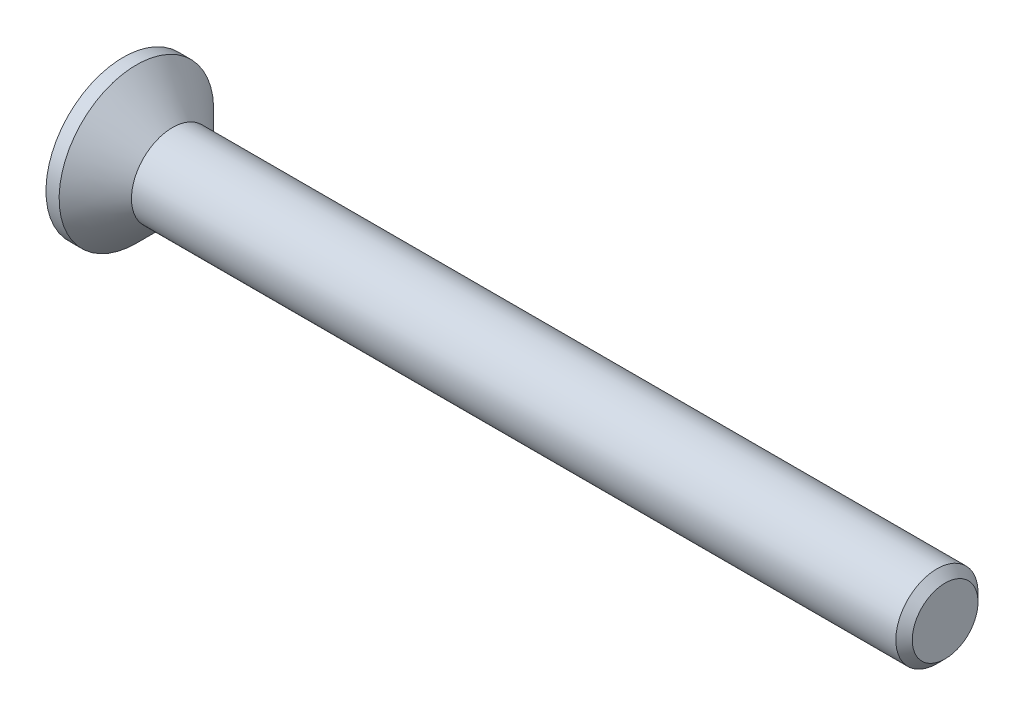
ISO-10303-21;
HEADER;
FILE_DESCRIPTION(('STEP AP214'),'2;1');
FILE_NAME('part.step','',(''),(''),'','','');
FILE_SCHEMA(('AUTOMOTIVE_DESIGN { 1 0 10303 214 1 1 1 1 }'));
ENDSEC;
DATA;
#1=APPLICATION_CONTEXT('core data for automotive mechanical design processes');
#2=APPLICATION_PROTOCOL_DEFINITION('international standard','automotive_design',2000,#1);
#3=PRODUCT_CONTEXT('',#1,'mechanical');
#4=PRODUCT('Part','Part','',(#3));
#5=PRODUCT_RELATED_PRODUCT_CATEGORY('part','',(#4));
#6=PRODUCT_DEFINITION_FORMATION('','',#4);
#7=PRODUCT_DEFINITION_CONTEXT('part definition',#1,'design');
#8=PRODUCT_DEFINITION('design','',#6,#7);
#9=PRODUCT_DEFINITION_SHAPE('','',#8);
#10=(LENGTH_UNIT() NAMED_UNIT(*) SI_UNIT(.MILLI.,.METRE.));
#11=(NAMED_UNIT(*) PLANE_ANGLE_UNIT() SI_UNIT($,.RADIAN.));
#12=(NAMED_UNIT(*) SI_UNIT($,.STERADIAN.) SOLID_ANGLE_UNIT());
#13=UNCERTAINTY_MEASURE_WITH_UNIT(LENGTH_MEASURE(1.E-05),#10,'distance_accuracy_value','');
#14=(GEOMETRIC_REPRESENTATION_CONTEXT(3) GLOBAL_UNCERTAINTY_ASSIGNED_CONTEXT((#13)) GLOBAL_UNIT_ASSIGNED_CONTEXT((#10,
#11,#12)) REPRESENTATION_CONTEXT('',''));
#15=CARTESIAN_POINT('',(0.,0.,0.));
#16=DIRECTION('',(0.,0.,1.));
#17=DIRECTION('',(1.,0.,0.));
#18=AXIS2_PLACEMENT_3D('',#15,#16,#17);
#19=CARTESIAN_POINT('',(0.,0.,0.));
#20=DIRECTION('',(-1.,0.,0.));
#21=DIRECTION('',(0.,-1.,0.));
#22=AXIS2_PLACEMENT_3D('',#19,#20,#21);
#23=CONICAL_SURFACE('',#22,1.25,0.78539816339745);
#24=CARTESIAN_POINT('',(-1.1,0.,0.));
#25=DIRECTION('',(-1.,0.,0.));
#26=DIRECTION('',(0.,-1.,0.));
#27=AXIS2_PLACEMENT_3D('',#24,#25,#26);
#28=CIRCLE('',#27,2.35);
#29=CARTESIAN_POINT('',(-1.1,-2.35,0.));
#30=VERTEX_POINT('',#29);
#31=EDGE_CURVE('E189',#30,#30,#28,.T.);
#32=ORIENTED_EDGE('',*,*,#31,.F.);
#33=EDGE_LOOP('',(#32));
#34=FACE_BOUND('',#33,.T.);
#35=CARTESIAN_POINT('',(0.,0.,0.));
#36=DIRECTION('',(-1.,0.,0.));
#37=DIRECTION('',(0.,-1.,0.));
#38=AXIS2_PLACEMENT_3D('',#35,#36,#37);
#39=CIRCLE('',#38,1.25);
#40=CARTESIAN_POINT('',(0.,-1.25,0.));
#41=VERTEX_POINT('',#40);
#42=EDGE_CURVE('E212',#41,#41,#39,.T.);
#43=ORIENTED_EDGE('',*,*,#42,.T.);
#44=EDGE_LOOP('',(#43));
#45=FACE_BOUND('',#44,.T.);
#46=ADVANCED_FACE('F33',(#34,#45),#23,.T.);
#47=CARTESIAN_POINT('',(-1.5,0.,0.));
#48=DIRECTION('',(-1.,0.,0.));
#49=DIRECTION('',(0.,-1.,0.));
#50=AXIS2_PLACEMENT_3D('',#47,#48,#49);
#51=CYLINDRICAL_SURFACE('',#50,1.25);
#52=CARTESIAN_POINT('',(23.25,0.,0.));
#53=DIRECTION('',(-1.,0.,0.));
#54=DIRECTION('',(0.,-1.,0.));
#55=AXIS2_PLACEMENT_3D('',#52,#53,#54);
#56=CIRCLE('',#55,1.25);
#57=CARTESIAN_POINT('',(23.25,-1.25,0.));
#58=VERTEX_POINT('',#57);
#59=EDGE_CURVE('E41',#58,#58,#56,.T.);
#60=ORIENTED_EDGE('',*,*,#59,.T.);
#61=EDGE_LOOP('',(#60));
#62=FACE_BOUND('',#61,.T.);
#63=ORIENTED_EDGE('',*,*,#42,.F.);
#64=EDGE_LOOP('',(#63));
#65=FACE_BOUND('',#64,.T.);
#66=ADVANCED_FACE('F217',(#62,#65),#51,.T.);
#67=CARTESIAN_POINT('',(23.5,0.,0.));
#68=DIRECTION('',(-1.,0.,0.));
#69=DIRECTION('',(0.,-1.,0.));
#70=AXIS2_PLACEMENT_3D('',#67,#68,#69);
#71=PLANE('',#70);
#72=CARTESIAN_POINT('',(23.5,0.,0.));
#73=DIRECTION('',(-1.,0.,0.));
#74=DIRECTION('',(0.,-1.,0.));
#75=AXIS2_PLACEMENT_3D('',#72,#73,#74);
#76=CIRCLE('',#75,1.);
#77=CARTESIAN_POINT('',(23.5,-1.,0.));
#78=VERTEX_POINT('',#77);
#79=EDGE_CURVE('E11',#78,#78,#76,.F.);
#80=ORIENTED_EDGE('',*,*,#79,.T.);
#81=EDGE_LOOP('',(#80));
#82=FACE_BOUND('',#81,.T.);
#83=ADVANCED_FACE('F239',(#82),#71,.F.);
#84=CARTESIAN_POINT('',(-1.5,2.35,0.));
#85=DIRECTION('',(1.,0.,0.));
#86=DIRECTION('',(0.,1.,0.));
#87=AXIS2_PLACEMENT_3D('',#84,#85,#86);
#88=PLANE('',#87);
#89=DIRECTION('',(0.,0.,-1.));
#90=VECTOR('',#89,1.);
#91=CARTESIAN_POINT('',(-1.5,0.34,-1.35));
#92=LINE('',#91,#90);
#93=CARTESIAN_POINT('',(-1.5,0.34,-0.34));
#94=VERTEX_POINT('',#93);
#95=CARTESIAN_POINT('',(-1.5,0.34,-1.35));
#96=VERTEX_POINT('',#95);
#97=EDGE_CURVE('E158',#94,#96,#92,.T.);
#98=ORIENTED_EDGE('',*,*,#97,.F.);
#99=DIRECTION('',(0.,-1.,0.));
#100=VECTOR('',#99,1.);
#101=CARTESIAN_POINT('',(-1.5,0.34,-0.34));
#102=LINE('',#101,#100);
#103=CARTESIAN_POINT('',(-1.5,1.35,-0.34));
#104=VERTEX_POINT('',#103);
#105=EDGE_CURVE('E48',#104,#94,#102,.T.);
#106=ORIENTED_EDGE('',*,*,#105,.F.);
#107=DIRECTION('',(0.,0.,-1.));
#108=VECTOR('',#107,1.);
#109=CARTESIAN_POINT('',(-1.5,1.35,-0.34));
#110=LINE('',#109,#108);
#111=CARTESIAN_POINT('',(-1.5,1.35,0.34));
#112=VERTEX_POINT('',#111);
#113=EDGE_CURVE('E185',#112,#104,#110,.T.);
#114=ORIENTED_EDGE('',*,*,#113,.F.);
#115=DIRECTION('',(0.,1.,0.));
#116=VECTOR('',#115,1.);
#117=CARTESIAN_POINT('',(-1.5,1.35,0.34));
#118=LINE('',#117,#116);
#119=CARTESIAN_POINT('',(-1.5,0.34,0.34));
#120=VERTEX_POINT('',#119);
#121=EDGE_CURVE('E183',#120,#112,#118,.T.);
#122=ORIENTED_EDGE('',*,*,#121,.F.);
#123=DIRECTION('',(0.,0.,-1.));
#124=VECTOR('',#123,1.);
#125=CARTESIAN_POINT('',(-1.5,0.34,0.34));
#126=LINE('',#125,#124);
#127=CARTESIAN_POINT('',(-1.5,0.34,1.35));
#128=VERTEX_POINT('',#127);
#129=EDGE_CURVE('E132',#128,#120,#126,.T.);
#130=ORIENTED_EDGE('',*,*,#129,.F.);
#131=DIRECTION('',(0.,1.,0.));
#132=VECTOR('',#131,1.);
#133=CARTESIAN_POINT('',(-1.5,0.34,1.35));
#134=LINE('',#133,#132);
#135=CARTESIAN_POINT('',(-1.5,-0.34,1.35));
#136=VERTEX_POINT('',#135);
#137=EDGE_CURVE('E179',#136,#128,#134,.T.);
#138=ORIENTED_EDGE('',*,*,#137,.F.);
#139=DIRECTION('',(0.,0.,1.));
#140=VECTOR('',#139,1.);
#141=CARTESIAN_POINT('',(-1.5,-0.34,1.35));
#142=LINE('',#141,#140);
#143=CARTESIAN_POINT('',(-1.5,-0.34,0.34));
#144=VERTEX_POINT('',#143);
#145=EDGE_CURVE('E176',#144,#136,#142,.T.);
#146=ORIENTED_EDGE('',*,*,#145,.F.);
#147=DIRECTION('',(0.,1.,0.));
#148=VECTOR('',#147,1.);
#149=CARTESIAN_POINT('',(-1.5,-0.34,0.34));
#150=LINE('',#149,#148);
#151=CARTESIAN_POINT('',(-1.5,-1.35,0.34));
#152=VERTEX_POINT('',#151);
#153=EDGE_CURVE('E173',#152,#144,#150,.T.);
#154=ORIENTED_EDGE('',*,*,#153,.F.);
#155=DIRECTION('',(0.,0.,1.));
#156=VECTOR('',#155,1.);
#157=CARTESIAN_POINT('',(-1.5,-1.35,0.34));
#158=LINE('',#157,#156);
#159=CARTESIAN_POINT('',(-1.5,-1.35,-0.34));
#160=VERTEX_POINT('',#159);
#161=EDGE_CURVE('E170',#160,#152,#158,.T.);
#162=ORIENTED_EDGE('',*,*,#161,.F.);
#163=DIRECTION('',(0.,-1.,0.));
#164=VECTOR('',#163,1.);
#165=CARTESIAN_POINT('',(-1.5,-1.35,-0.34));
#166=LINE('',#165,#164);
#167=CARTESIAN_POINT('',(-1.5,-0.34,-0.34));
#168=VERTEX_POINT('',#167);
#169=EDGE_CURVE('E167',#168,#160,#166,.T.);
#170=ORIENTED_EDGE('',*,*,#169,.F.);
#171=DIRECTION('',(0.,0.,1.));
#172=VECTOR('',#171,1.);
#173=CARTESIAN_POINT('',(-1.5,-0.34,-0.34));
#174=LINE('',#173,#172);
#175=CARTESIAN_POINT('',(-1.5,-0.34,-1.35));
#176=VERTEX_POINT('',#175);
#177=EDGE_CURVE('E164',#176,#168,#174,.T.);
#178=ORIENTED_EDGE('',*,*,#177,.F.);
#179=DIRECTION('',(0.,-1.,0.));
#180=VECTOR('',#179,1.);
#181=CARTESIAN_POINT('',(-1.5,-0.34,-1.35));
#182=LINE('',#181,#180);
#183=EDGE_CURVE('E161',#96,#176,#182,.T.);
#184=ORIENTED_EDGE('',*,*,#183,.F.);
#185=EDGE_LOOP('',(#98,#106,#114,#122,#130,#138,#146,#154,#162,#170,#178,#184));
#186=FACE_BOUND('',#185,.T.);
#187=CARTESIAN_POINT('',(-1.5,0.,0.));
#188=DIRECTION('',(-1.,0.,0.));
#189=DIRECTION('',(0.,-1.,0.));
#190=AXIS2_PLACEMENT_3D('',#187,#188,#189);
#191=CIRCLE('',#190,2.35);
#192=CARTESIAN_POINT('',(-1.5,-2.35,0.));
#193=VERTEX_POINT('',#192);
#194=EDGE_CURVE('E209',#193,#193,#191,.T.);
#195=ORIENTED_EDGE('',*,*,#194,.T.);
#196=EDGE_LOOP('',(#195));
#197=FACE_BOUND('',#196,.T.);
#198=ADVANCED_FACE('F230',(#186,#197),#88,.F.);
#199=CARTESIAN_POINT('',(-1.5,0.,0.));
#200=DIRECTION('',(-1.,0.,0.));
#201=DIRECTION('',(0.,-1.,0.));
#202=AXIS2_PLACEMENT_3D('',#199,#200,#201);
#203=CYLINDRICAL_SURFACE('',#202,2.35);
#204=ORIENTED_EDGE('',*,*,#194,.F.);
#205=EDGE_LOOP('',(#204));
#206=FACE_BOUND('',#205,.T.);
#207=ORIENTED_EDGE('',*,*,#31,.T.);
#208=EDGE_LOOP('',(#207));
#209=FACE_BOUND('',#208,.T.);
#210=ADVANCED_FACE('F222',(#206,#209),#203,.T.);
#211=CARTESIAN_POINT('',(23.25,0.,0.));
#212=DIRECTION('',(-1.,0.,0.));
#213=DIRECTION('',(0.,-1.,0.));
#214=AXIS2_PLACEMENT_3D('',#211,#212,#213);
#215=CONICAL_SURFACE('',#214,1.25,0.785398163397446);
#216=ORIENTED_EDGE('',*,*,#79,.F.);
#217=EDGE_LOOP('',(#216));
#218=FACE_BOUND('',#217,.T.);
#219=ORIENTED_EDGE('',*,*,#59,.F.);
#220=EDGE_LOOP('',(#219));
#221=FACE_BOUND('',#220,.T.);
#222=ADVANCED_FACE('F35',(#218,#221),#215,.T.);
#223=CARTESIAN_POINT('',(-0.25,0.34,-0.34));
#224=DIRECTION('',(0.,0.,-1.));
#225=DIRECTION('',(-1.,0.,0.));
#226=AXIS2_PLACEMENT_3D('',#223,#224,#225);
#227=PLANE('',#226);
#228=ORIENTED_EDGE('',*,*,#105,.T.);
#229=DIRECTION('',(-1.,0.,0.));
#230=VECTOR('',#229,1.);
#231=CARTESIAN_POINT('',(-0.25,0.34,-0.34));
#232=LINE('',#231,#230);
#233=CARTESIAN_POINT('',(-0.25,0.34,-0.34));
#234=VERTEX_POINT('',#233);
#235=EDGE_CURVE('E96',#234,#94,#232,.T.);
#236=ORIENTED_EDGE('',*,*,#235,.F.);
#237=DIRECTION('',(0.,-1.,0.));
#238=VECTOR('',#237,1.);
#239=CARTESIAN_POINT('',(-0.25,0.34,-0.34));
#240=LINE('',#239,#238);
#241=CARTESIAN_POINT('',(-0.25,1.35,-0.34));
#242=VERTEX_POINT('',#241);
#243=EDGE_CURVE('E187',#242,#234,#240,.T.);
#244=ORIENTED_EDGE('',*,*,#243,.F.);
#245=DIRECTION('',(-1.,0.,0.));
#246=VECTOR('',#245,1.);
#247=CARTESIAN_POINT('',(-0.25,1.35,-0.34));
#248=LINE('',#247,#246);
#249=EDGE_CURVE('E56',#242,#104,#248,.T.);
#250=ORIENTED_EDGE('',*,*,#249,.T.);
#251=EDGE_LOOP('',(#228,#236,#244,#250));
#252=FACE_BOUND('',#251,.T.);
#253=ADVANCED_FACE('F221',(#252),#227,.F.);
#254=CARTESIAN_POINT('',(-0.25,1.35,-0.34));
#255=DIRECTION('',(0.,1.,0.));
#256=DIRECTION('',(-1.,0.,0.));
#257=AXIS2_PLACEMENT_3D('',#254,#255,#256);
#258=PLANE('',#257);
#259=ORIENTED_EDGE('',*,*,#113,.T.);
#260=ORIENTED_EDGE('',*,*,#249,.F.);
#261=DIRECTION('',(0.,0.,-1.));
#262=VECTOR('',#261,1.);
#263=CARTESIAN_POINT('',(-0.25,1.35,-0.34));
#264=LINE('',#263,#262);
#265=CARTESIAN_POINT('',(-0.25,1.35,0.34));
#266=VERTEX_POINT('',#265);
#267=EDGE_CURVE('E144',#266,#242,#264,.T.);
#268=ORIENTED_EDGE('',*,*,#267,.F.);
#269=DIRECTION('',(-1.,0.,0.));
#270=VECTOR('',#269,1.);
#271=CARTESIAN_POINT('',(-0.25,1.35,0.34));
#272=LINE('',#271,#270);
#273=EDGE_CURVE('E136',#266,#112,#272,.T.);
#274=ORIENTED_EDGE('',*,*,#273,.T.);
#275=EDGE_LOOP('',(#259,#260,#268,#274));
#276=FACE_BOUND('',#275,.T.);
#277=ADVANCED_FACE('F228',(#276),#258,.F.);
#278=CARTESIAN_POINT('',(-0.25,1.35,0.34));
#279=DIRECTION('',(0.,0.,1.));
#280=DIRECTION('',(1.,0.,0.));
#281=AXIS2_PLACEMENT_3D('',#278,#279,#280);
#282=PLANE('',#281);
#283=ORIENTED_EDGE('',*,*,#121,.T.);
#284=ORIENTED_EDGE('',*,*,#273,.F.);
#285=DIRECTION('',(0.,1.,0.));
#286=VECTOR('',#285,1.);
#287=CARTESIAN_POINT('',(-0.25,1.35,0.34));
#288=LINE('',#287,#286);
#289=CARTESIAN_POINT('',(-0.25,0.34,0.34));
#290=VERTEX_POINT('',#289);
#291=EDGE_CURVE('E140',#290,#266,#288,.T.);
#292=ORIENTED_EDGE('',*,*,#291,.F.);
#293=DIRECTION('',(-1.,0.,0.));
#294=VECTOR('',#293,1.);
#295=CARTESIAN_POINT('',(-0.25,0.34,0.34));
#296=LINE('',#295,#294);
#297=EDGE_CURVE('E125',#290,#120,#296,.T.);
#298=ORIENTED_EDGE('',*,*,#297,.T.);
#299=EDGE_LOOP('',(#283,#284,#292,#298));
#300=FACE_BOUND('',#299,.T.);
#301=ADVANCED_FACE('F141',(#300),#282,.F.);
#302=CARTESIAN_POINT('',(-0.25,0.34,0.34));
#303=DIRECTION('',(0.,1.,0.));
#304=DIRECTION('',(-1.,0.,0.));
#305=AXIS2_PLACEMENT_3D('',#302,#303,#304);
#306=PLANE('',#305);
#307=ORIENTED_EDGE('',*,*,#129,.T.);
#308=ORIENTED_EDGE('',*,*,#297,.F.);
#309=DIRECTION('',(0.,0.,-1.));
#310=VECTOR('',#309,1.);
#311=CARTESIAN_POINT('',(-0.25,0.34,0.34));
#312=LINE('',#311,#310);
#313=CARTESIAN_POINT('',(-0.25,0.34,1.35));
#314=VERTEX_POINT('',#313);
#315=EDGE_CURVE('E129',#314,#290,#312,.T.);
#316=ORIENTED_EDGE('',*,*,#315,.F.);
#317=DIRECTION('',(-1.,0.,0.));
#318=VECTOR('',#317,1.);
#319=CARTESIAN_POINT('',(-0.25,0.34,1.35));
#320=LINE('',#319,#318);
#321=EDGE_CURVE('E137',#314,#128,#320,.T.);
#322=ORIENTED_EDGE('',*,*,#321,.T.);
#323=EDGE_LOOP('',(#307,#308,#316,#322));
#324=FACE_BOUND('',#323,.T.);
#325=ADVANCED_FACE('F127',(#324),#306,.F.);
#326=CARTESIAN_POINT('',(-0.25,0.34,1.35));
#327=DIRECTION('',(0.,0.,1.));
#328=DIRECTION('',(1.,0.,0.));
#329=AXIS2_PLACEMENT_3D('',#326,#327,#328);
#330=PLANE('',#329);
#331=ORIENTED_EDGE('',*,*,#137,.T.);
#332=ORIENTED_EDGE('',*,*,#321,.F.);
#333=DIRECTION('',(0.,1.,0.));
#334=VECTOR('',#333,1.);
#335=CARTESIAN_POINT('',(-0.25,0.34,1.35));
#336=LINE('',#335,#334);
#337=CARTESIAN_POINT('',(-0.25,-0.34,1.35));
#338=VERTEX_POINT('',#337);
#339=EDGE_CURVE('E150',#338,#314,#336,.T.);
#340=ORIENTED_EDGE('',*,*,#339,.F.);
#341=DIRECTION('',(-1.,0.,0.));
#342=VECTOR('',#341,1.);
#343=CARTESIAN_POINT('',(-0.25,-0.34,1.35));
#344=LINE('',#343,#342);
#345=EDGE_CURVE('E192',#338,#136,#344,.T.);
#346=ORIENTED_EDGE('',*,*,#345,.T.);
#347=EDGE_LOOP('',(#331,#332,#340,#346));
#348=FACE_BOUND('',#347,.T.);
#349=ADVANCED_FACE('F277',(#348),#330,.F.);
#350=CARTESIAN_POINT('',(-0.25,-0.34,1.35));
#351=DIRECTION('',(0.,-1.,0.));
#352=DIRECTION('',(1.,0.,0.));
#353=AXIS2_PLACEMENT_3D('',#350,#351,#352);
#354=PLANE('',#353);
#355=ORIENTED_EDGE('',*,*,#145,.T.);
#356=ORIENTED_EDGE('',*,*,#345,.F.);
#357=DIRECTION('',(0.,0.,1.));
#358=VECTOR('',#357,1.);
#359=CARTESIAN_POINT('',(-0.25,-0.34,1.35));
#360=LINE('',#359,#358);
#361=CARTESIAN_POINT('',(-0.25,-0.34,0.34));
#362=VERTEX_POINT('',#361);
#363=EDGE_CURVE('E152',#362,#338,#360,.T.);
#364=ORIENTED_EDGE('',*,*,#363,.F.);
#365=DIRECTION('',(-1.,0.,0.));
#366=VECTOR('',#365,1.);
#367=CARTESIAN_POINT('',(-0.25,-0.34,0.34));
#368=LINE('',#367,#366);
#369=EDGE_CURVE('E194',#362,#144,#368,.T.);
#370=ORIENTED_EDGE('',*,*,#369,.T.);
#371=EDGE_LOOP('',(#355,#356,#364,#370));
#372=FACE_BOUND('',#371,.T.);
#373=ADVANCED_FACE('F273',(#372),#354,.F.);
#374=CARTESIAN_POINT('',(-0.25,-0.34,0.34));
#375=DIRECTION('',(0.,0.,1.));
#376=DIRECTION('',(1.,0.,0.));
#377=AXIS2_PLACEMENT_3D('',#374,#375,#376);
#378=PLANE('',#377);
#379=ORIENTED_EDGE('',*,*,#153,.T.);
#380=ORIENTED_EDGE('',*,*,#369,.F.);
#381=DIRECTION('',(0.,1.,0.));
#382=VECTOR('',#381,1.);
#383=CARTESIAN_POINT('',(-0.25,-0.34,0.34));
#384=LINE('',#383,#382);
#385=CARTESIAN_POINT('',(-0.25,-1.35,0.34));
#386=VERTEX_POINT('',#385);
#387=EDGE_CURVE('E422',#386,#362,#384,.T.);
#388=ORIENTED_EDGE('',*,*,#387,.F.);
#389=DIRECTION('',(-1.,0.,0.));
#390=VECTOR('',#389,1.);
#391=CARTESIAN_POINT('',(-0.25,-1.35,0.34));
#392=LINE('',#391,#390);
#393=EDGE_CURVE('E196',#386,#152,#392,.T.);
#394=ORIENTED_EDGE('',*,*,#393,.T.);
#395=EDGE_LOOP('',(#379,#380,#388,#394));
#396=FACE_BOUND('',#395,.T.);
#397=ADVANCED_FACE('F269',(#396),#378,.F.);
#398=CARTESIAN_POINT('',(-0.25,-1.35,0.34));
#399=DIRECTION('',(0.,-1.,0.));
#400=DIRECTION('',(1.,0.,0.));
#401=AXIS2_PLACEMENT_3D('',#398,#399,#400);
#402=PLANE('',#401);
#403=ORIENTED_EDGE('',*,*,#161,.T.);
#404=ORIENTED_EDGE('',*,*,#393,.F.);
#405=DIRECTION('',(0.,0.,1.));
#406=VECTOR('',#405,1.);
#407=CARTESIAN_POINT('',(-0.25,-1.35,0.34));
#408=LINE('',#407,#406);
#409=CARTESIAN_POINT('',(-0.25,-1.35,-0.34));
#410=VERTEX_POINT('',#409);
#411=EDGE_CURVE('E419',#410,#386,#408,.T.);
#412=ORIENTED_EDGE('',*,*,#411,.F.);
#413=DIRECTION('',(-1.,0.,0.));
#414=VECTOR('',#413,1.);
#415=CARTESIAN_POINT('',(-0.25,-1.35,-0.34));
#416=LINE('',#415,#414);
#417=EDGE_CURVE('E198',#410,#160,#416,.T.);
#418=ORIENTED_EDGE('',*,*,#417,.T.);
#419=EDGE_LOOP('',(#403,#404,#412,#418));
#420=FACE_BOUND('',#419,.T.);
#421=ADVANCED_FACE('F265',(#420),#402,.F.);
#422=CARTESIAN_POINT('',(-0.25,-1.35,-0.34));
#423=DIRECTION('',(0.,0.,-1.));
#424=DIRECTION('',(-1.,0.,0.));
#425=AXIS2_PLACEMENT_3D('',#422,#423,#424);
#426=PLANE('',#425);
#427=ORIENTED_EDGE('',*,*,#169,.T.);
#428=ORIENTED_EDGE('',*,*,#417,.F.);
#429=DIRECTION('',(0.,-1.,0.));
#430=VECTOR('',#429,1.);
#431=CARTESIAN_POINT('',(-0.25,-1.35,-0.34));
#432=LINE('',#431,#430);
#433=CARTESIAN_POINT('',(-0.25,-0.34,-0.34));
#434=VERTEX_POINT('',#433);
#435=EDGE_CURVE('E416',#434,#410,#432,.T.);
#436=ORIENTED_EDGE('',*,*,#435,.F.);
#437=DIRECTION('',(-1.,0.,0.));
#438=VECTOR('',#437,1.);
#439=CARTESIAN_POINT('',(-0.25,-0.34,-0.34));
#440=LINE('',#439,#438);
#441=EDGE_CURVE('E200',#434,#168,#440,.T.);
#442=ORIENTED_EDGE('',*,*,#441,.T.);
#443=EDGE_LOOP('',(#427,#428,#436,#442));
#444=FACE_BOUND('',#443,.T.);
#445=ADVANCED_FACE('F261',(#444),#426,.F.);
#446=CARTESIAN_POINT('',(-0.25,-0.34,-0.34));
#447=DIRECTION('',(0.,-1.,0.));
#448=DIRECTION('',(1.,0.,0.));
#449=AXIS2_PLACEMENT_3D('',#446,#447,#448);
#450=PLANE('',#449);
#451=ORIENTED_EDGE('',*,*,#177,.T.);
#452=ORIENTED_EDGE('',*,*,#441,.F.);
#453=DIRECTION('',(0.,0.,1.));
#454=VECTOR('',#453,1.);
#455=CARTESIAN_POINT('',(-0.25,-0.34,-0.34));
#456=LINE('',#455,#454);
#457=CARTESIAN_POINT('',(-0.25,-0.34,-1.35));
#458=VERTEX_POINT('',#457);
#459=EDGE_CURVE('E413',#458,#434,#456,.T.);
#460=ORIENTED_EDGE('',*,*,#459,.F.);
#461=DIRECTION('',(-1.,0.,0.));
#462=VECTOR('',#461,1.);
#463=CARTESIAN_POINT('',(-0.25,-0.34,-1.35));
#464=LINE('',#463,#462);
#465=EDGE_CURVE('E202',#458,#176,#464,.T.);
#466=ORIENTED_EDGE('',*,*,#465,.T.);
#467=EDGE_LOOP('',(#451,#452,#460,#466));
#468=FACE_BOUND('',#467,.T.);
#469=ADVANCED_FACE('F257',(#468),#450,.F.);
#470=CARTESIAN_POINT('',(-0.25,-0.34,-1.35));
#471=DIRECTION('',(0.,0.,-1.));
#472=DIRECTION('',(-1.,0.,0.));
#473=AXIS2_PLACEMENT_3D('',#470,#471,#472);
#474=PLANE('',#473);
#475=ORIENTED_EDGE('',*,*,#183,.T.);
#476=ORIENTED_EDGE('',*,*,#465,.F.);
#477=DIRECTION('',(0.,-1.,0.));
#478=VECTOR('',#477,1.);
#479=CARTESIAN_POINT('',(-0.25,-0.34,-1.35));
#480=LINE('',#479,#478);
#481=CARTESIAN_POINT('',(-0.25,0.34,-1.35));
#482=VERTEX_POINT('',#481);
#483=EDGE_CURVE('E408',#482,#458,#480,.T.);
#484=ORIENTED_EDGE('',*,*,#483,.F.);
#485=DIRECTION('',(-1.,0.,0.));
#486=VECTOR('',#485,1.);
#487=CARTESIAN_POINT('',(-0.25,0.34,-1.35));
#488=LINE('',#487,#486);
#489=EDGE_CURVE('E204',#482,#96,#488,.T.);
#490=ORIENTED_EDGE('',*,*,#489,.T.);
#491=EDGE_LOOP('',(#475,#476,#484,#490));
#492=FACE_BOUND('',#491,.T.);
#493=ADVANCED_FACE('F253',(#492),#474,.F.);
#494=CARTESIAN_POINT('',(-0.25,0.34,-1.35));
#495=DIRECTION('',(0.,1.,0.));
#496=DIRECTION('',(-1.,0.,0.));
#497=AXIS2_PLACEMENT_3D('',#494,#495,#496);
#498=PLANE('',#497);
#499=ORIENTED_EDGE('',*,*,#97,.T.);
#500=ORIENTED_EDGE('',*,*,#489,.F.);
#501=DIRECTION('',(0.,0.,-1.));
#502=VECTOR('',#501,1.);
#503=CARTESIAN_POINT('',(-0.25,0.34,-1.35));
#504=LINE('',#503,#502);
#505=EDGE_CURVE('E406',#234,#482,#504,.T.);
#506=ORIENTED_EDGE('',*,*,#505,.F.);
#507=ORIENTED_EDGE('',*,*,#235,.T.);
#508=EDGE_LOOP('',(#499,#500,#506,#507));
#509=FACE_BOUND('',#508,.T.);
#510=ADVANCED_FACE('F250',(#509),#498,.F.);
#511=CARTESIAN_POINT('',(-0.25,0.,0.));
#512=DIRECTION('',(1.,0.,0.));
#513=DIRECTION('',(0.,0.,-1.));
#514=AXIS2_PLACEMENT_3D('',#511,#512,#513);
#515=PLANE('',#514);
#516=ORIENTED_EDGE('',*,*,#243,.T.);
#517=ORIENTED_EDGE('',*,*,#505,.T.);
#518=ORIENTED_EDGE('',*,*,#483,.T.);
#519=ORIENTED_EDGE('',*,*,#459,.T.);
#520=ORIENTED_EDGE('',*,*,#435,.T.);
#521=ORIENTED_EDGE('',*,*,#411,.T.);
#522=ORIENTED_EDGE('',*,*,#387,.T.);
#523=ORIENTED_EDGE('',*,*,#363,.T.);
#524=ORIENTED_EDGE('',*,*,#339,.T.);
#525=ORIENTED_EDGE('',*,*,#315,.T.);
#526=ORIENTED_EDGE('',*,*,#291,.T.);
#527=ORIENTED_EDGE('',*,*,#267,.T.);
#528=EDGE_LOOP('',(#516,#517,#518,#519,#520,#521,#522,#523,#524,#525,#526,#527));
#529=FACE_BOUND('',#528,.T.);
#530=ADVANCED_FACE('F147',(#529),#515,.F.);
#531=CLOSED_SHELL('',(#46,#66,#83,#198,#210,#222,#253,#277,#301,#325,#349,#373,#397,#421,#445,
#469,#493,#510,#530));
#532=MANIFOLD_SOLID_BREP('B2',#531);
#533=ADVANCED_BREP_SHAPE_REPRESENTATION('',(#18,#532),#14);
#534=SHAPE_DEFINITION_REPRESENTATION(#9,#533);
ENDSEC;
END-ISO-10303-21;
